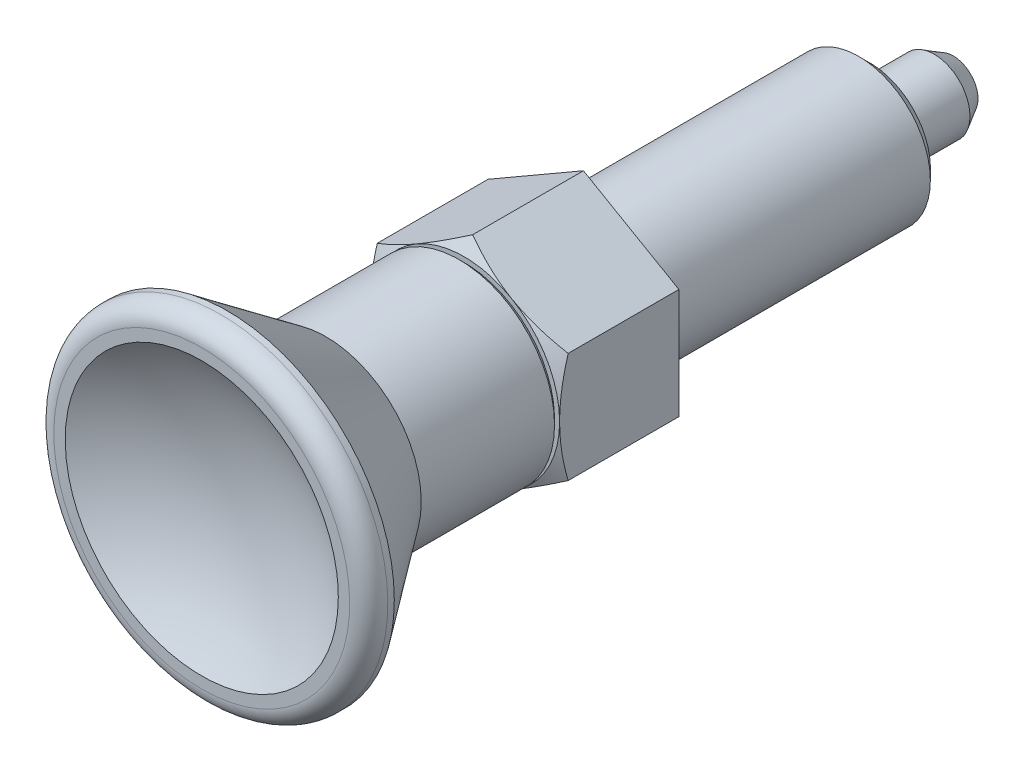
ISO-10303-21;
HEADER;
FILE_DESCRIPTION(('STEP AP214'),'2;1');
FILE_NAME('part.step','',(''),(''),'','','');
FILE_SCHEMA(('AUTOMOTIVE_DESIGN { 1 0 10303 214 1 1 1 1 }'));
ENDSEC;
DATA;
#1=APPLICATION_CONTEXT('core data for automotive mechanical design processes');
#2=APPLICATION_PROTOCOL_DEFINITION('international standard','automotive_design',2000,#1);
#3=PRODUCT_CONTEXT('',#1,'mechanical');
#4=PRODUCT('Part','Part','',(#3));
#5=PRODUCT_RELATED_PRODUCT_CATEGORY('part','',(#4));
#6=PRODUCT_DEFINITION_FORMATION('','',#4);
#7=PRODUCT_DEFINITION_CONTEXT('part definition',#1,'design');
#8=PRODUCT_DEFINITION('design','',#6,#7);
#9=PRODUCT_DEFINITION_SHAPE('','',#8);
#10=(LENGTH_UNIT() NAMED_UNIT(*) SI_UNIT(.MILLI.,.METRE.));
#11=(NAMED_UNIT(*) PLANE_ANGLE_UNIT() SI_UNIT($,.RADIAN.));
#12=(NAMED_UNIT(*) SI_UNIT($,.STERADIAN.) SOLID_ANGLE_UNIT());
#13=UNCERTAINTY_MEASURE_WITH_UNIT(LENGTH_MEASURE(1.E-05),#10,'distance_accuracy_value','');
#14=(GEOMETRIC_REPRESENTATION_CONTEXT(3) GLOBAL_UNCERTAINTY_ASSIGNED_CONTEXT((#13)) GLOBAL_UNIT_ASSIGNED_CONTEXT((#10,
#11,#12)) REPRESENTATION_CONTEXT('',''));
#15=CARTESIAN_POINT('',(0.,0.,0.));
#16=DIRECTION('',(0.,0.,1.));
#17=DIRECTION('',(1.,0.,0.));
#18=AXIS2_PLACEMENT_3D('',#15,#16,#17);
#19=CARTESIAN_POINT('',(0.,0.,0.));
#20=DIRECTION('',(0.,0.,1.));
#21=DIRECTION('',(0.,-1.,0.));
#22=AXIS2_PLACEMENT_3D('',#19,#20,#21);
#23=CYLINDRICAL_SURFACE('',#22,3.);
#24=CARTESIAN_POINT('',(0.,0.,0.));
#25=DIRECTION('',(0.,0.,1.));
#26=DIRECTION('',(0.,-1.,0.));
#27=AXIS2_PLACEMENT_3D('',#24,#25,#26);
#28=CIRCLE('',#27,3.);
#29=CARTESIAN_POINT('',(0.,-3.,0.));
#30=VERTEX_POINT('',#29);
#31=EDGE_CURVE('E129',#30,#30,#28,.T.);
#32=ORIENTED_EDGE('',*,*,#31,.F.);
#33=EDGE_LOOP('',(#32));
#34=FACE_BOUND('',#33,.T.);
#35=CARTESIAN_POINT('',(0.,0.,-11.54));
#36=DIRECTION('',(0.,0.,1.));
#37=DIRECTION('',(1.,0.,0.));
#38=AXIS2_PLACEMENT_3D('',#35,#36,#37);
#39=CIRCLE('',#38,3.);
#40=CARTESIAN_POINT('',(3.00000000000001,0.,-11.54));
#41=VERTEX_POINT('',#40);
#42=EDGE_CURVE('E382',#41,#41,#39,.T.);
#43=ORIENTED_EDGE('',*,*,#42,.T.);
#44=EDGE_LOOP('',(#43));
#45=FACE_BOUND('',#44,.T.);
#46=ADVANCED_FACE('F14',(#34,#45),#23,.T.);
#47=CARTESIAN_POINT('',(4.,-4.67422777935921,0.));
#48=DIRECTION('',(0.,0.,-1.));
#49=DIRECTION('',(-1.,0.,0.));
#50=AXIS2_PLACEMENT_3D('',#47,#48,#49);
#51=PLANE('',#50);
#52=ORIENTED_EDGE('',*,*,#31,.T.);
#53=EDGE_LOOP('',(#52));
#54=FACE_BOUND('',#53,.T.);
#55=DIRECTION('',(0.,-1.,0.));
#56=VECTOR('',#55,1.);
#57=CARTESIAN_POINT('',(-4.,0.,0.));
#58=LINE('',#57,#56);
#59=CARTESIAN_POINT('',(-4.,2.3094010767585,0.));
#60=VERTEX_POINT('',#59);
#61=CARTESIAN_POINT('',(-4.,-2.3094010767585,0.));
#62=VERTEX_POINT('',#61);
#63=EDGE_CURVE('E356',#60,#62,#58,.T.);
#64=ORIENTED_EDGE('',*,*,#63,.F.);
#65=DIRECTION('',(-0.866025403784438,-0.5,0.));
#66=VECTOR('',#65,1.);
#67=CARTESIAN_POINT('',(-2.,3.46410161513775,0.));
#68=LINE('',#67,#66);
#69=CARTESIAN_POINT('',(0.,4.61880215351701,0.));
#70=VERTEX_POINT('',#69);
#71=EDGE_CURVE('E371',#70,#60,#68,.T.);
#72=ORIENTED_EDGE('',*,*,#71,.F.);
#73=DIRECTION('',(-0.866025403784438,0.5,0.));
#74=VECTOR('',#73,1.);
#75=CARTESIAN_POINT('',(2.,3.46410161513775,0.));
#76=LINE('',#75,#74);
#77=CARTESIAN_POINT('',(4.,2.3094010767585,0.));
#78=VERTEX_POINT('',#77);
#79=EDGE_CURVE('E369',#78,#70,#76,.T.);
#80=ORIENTED_EDGE('',*,*,#79,.F.);
#81=DIRECTION('',(0.,1.,0.));
#82=VECTOR('',#81,1.);
#83=CARTESIAN_POINT('',(4.,0.,0.));
#84=LINE('',#83,#82);
#85=CARTESIAN_POINT('',(4.,-2.3094010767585,0.));
#86=VERTEX_POINT('',#85);
#87=EDGE_CURVE('E91',#86,#78,#84,.T.);
#88=ORIENTED_EDGE('',*,*,#87,.F.);
#89=DIRECTION('',(0.866025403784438,0.5,0.));
#90=VECTOR('',#89,1.);
#91=CARTESIAN_POINT('',(2.,-3.46410161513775,0.));
#92=LINE('',#91,#90);
#93=CARTESIAN_POINT('',(0.,-4.61880215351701,0.));
#94=VERTEX_POINT('',#93);
#95=EDGE_CURVE('E98',#94,#86,#92,.T.);
#96=ORIENTED_EDGE('',*,*,#95,.F.);
#97=DIRECTION('',(0.866025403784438,-0.5,0.));
#98=VECTOR('',#97,1.);
#99=CARTESIAN_POINT('',(-2.,-3.46410161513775,0.));
#100=LINE('',#99,#98);
#101=EDGE_CURVE('E349',#62,#94,#100,.T.);
#102=ORIENTED_EDGE('',*,*,#101,.F.);
#103=EDGE_LOOP('',(#64,#72,#80,#88,#96,#102));
#104=FACE_BOUND('',#103,.T.);
#105=ADVANCED_FACE('F242',(#54,#104),#51,.T.);
#106=CARTESIAN_POINT('',(0.,4.61880215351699,5.03));
#107=DIRECTION('',(0.5,0.866025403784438,0.));
#108=DIRECTION('',(0.866025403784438,-0.5,0.));
#109=AXIS2_PLACEMENT_3D('',#106,#107,#108);
#110=PLANE('',#109);
#111=CARTESIAN_POINT('',(4.,2.30940107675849,4.64273441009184));
#112=CARTESIAN_POINT('',(3.83720085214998,2.40339320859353,4.69701440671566));
#113=CARTESIAN_POINT('',(3.67309795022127,2.49813806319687,4.7467443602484));
#114=CARTESIAN_POINT('',(3.34344559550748,2.68846293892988,4.8344422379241));
#115=CARTESIAN_POINT('',(3.1779076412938,2.78403632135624,4.87246832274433));
#116=CARTESIAN_POINT('',(2.92803843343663,2.92829837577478,4.91915789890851));
#117=CARTESIAN_POINT('',(2.84443305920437,2.97656796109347,4.93300183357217));
#118=CARTESIAN_POINT('',(2.67682205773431,3.07333821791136,4.95696597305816));
#119=CARTESIAN_POINT('',(2.59281644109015,3.1218388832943,4.96708627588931));
#120=CARTESIAN_POINT('',(2.42409422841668,3.2192506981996,4.9834253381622));
#121=CARTESIAN_POINT('',(2.33937618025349,3.26816268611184,4.98962425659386));
#122=CARTESIAN_POINT('',(2.16977347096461,3.36608285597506,4.99792016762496));
#123=CARTESIAN_POINT('',(2.08488878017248,3.41509105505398,5.00001634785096));
#124=CARTESIAN_POINT('',(2.,3.46410161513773,5.));
#125=B_SPLINE_CURVE_WITH_KNOTS('',3,(#111,#112,#113,#114,#115,#116,#117,#118,#119,#120,#121,
#122,#123,#124),.UNSPECIFIED.,.F.,.F.,(4,2,2,2,2,2,4),(0.,0.587229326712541,1.17149154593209,
1.46400599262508,1.75651273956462,2.05048788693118,2.34452123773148),.UNSPECIFIED.);
#126=CARTESIAN_POINT('',(4.,2.30940107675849,4.64273441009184));
#127=VERTEX_POINT('',#126);
#128=CARTESIAN_POINT('',(2.,3.46410161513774,5.));
#129=VERTEX_POINT('',#128);
#130=EDGE_CURVE('E101',#127,#129,#125,.T.);
#131=ORIENTED_EDGE('',*,*,#130,.F.);
#132=DIRECTION('',(0.,0.,-1.));
#133=VECTOR('',#132,1.);
#134=CARTESIAN_POINT('',(4.,2.30940107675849,5.));
#135=LINE('',#134,#133);
#136=EDGE_CURVE('E93',#78,#127,#135,.F.);
#137=ORIENTED_EDGE('',*,*,#136,.F.);
#138=ORIENTED_EDGE('',*,*,#79,.T.);
#139=DIRECTION('',(0.,0.,-1.));
#140=VECTOR('',#139,1.);
#141=CARTESIAN_POINT('',(0.,4.61880215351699,5.));
#142=LINE('',#141,#140);
#143=CARTESIAN_POINT('',(-9.48905183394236E-12,4.61880215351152,4.642734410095));
#144=VERTEX_POINT('',#143);
#145=EDGE_CURVE('E375',#144,#70,#142,.T.);
#146=ORIENTED_EDGE('',*,*,#145,.F.);
#147=CARTESIAN_POINT('',(2.,3.46410161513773,5.));
#148=CARTESIAN_POINT('',(1.91511121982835,3.51311217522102,5.00001634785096));
#149=CARTESIAN_POINT('',(1.83022652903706,3.56212037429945,4.997920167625));
#150=CARTESIAN_POINT('',(1.66062381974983,3.66004054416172,4.98962425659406));
#151=CARTESIAN_POINT('',(1.57590577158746,3.70895253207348,4.98342533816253));
#152=CARTESIAN_POINT('',(1.40718355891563,3.80636434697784,4.96708627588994));
#153=CARTESIAN_POINT('',(1.32317794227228,3.85486501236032,4.95696597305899));
#154=CARTESIAN_POINT('',(1.15556694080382,3.95163526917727,4.93300183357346));
#155=CARTESIAN_POINT('',(1.07196156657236,3.99990485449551,4.91915789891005));
#156=CARTESIAN_POINT('',(0.822092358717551,4.14416690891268,4.87246832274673));
#157=CARTESIAN_POINT('',(0.656554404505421,4.23974029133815,4.83444223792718));
#158=CARTESIAN_POINT('',(0.326902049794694,4.43006516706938,4.746744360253));
#159=CARTESIAN_POINT('',(0.162799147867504,4.52481002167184,4.6970144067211));
#160=CARTESIAN_POINT('',(1.89834500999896E-11,4.61880215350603,4.64273441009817));
#161=B_SPLINE_CURVE_WITH_KNOTS('',3,(#147,#148,#149,#150,#151,#152,#153,#154,#155,#156,#157,
#158,#159,#160),.UNSPECIFIED.,.F.,.F.,(4,2,2,2,2,2,4),(0.,0.294033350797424,0.588008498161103,
0.880515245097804,1.17302969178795,1.75729191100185,2.34452123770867),.UNSPECIFIED.);
#162=EDGE_CURVE('E104',#129,#144,#161,.T.);
#163=ORIENTED_EDGE('',*,*,#162,.F.);
#164=EDGE_LOOP('',(#131,#137,#138,#146,#163));
#165=FACE_BOUND('',#164,.T.);
#166=ADVANCED_FACE('F102',(#165),#110,.T.);
#167=CARTESIAN_POINT('',(-4.,2.30940107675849,5.03));
#168=DIRECTION('',(-0.5,0.866025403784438,0.));
#169=DIRECTION('',(0.866025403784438,0.5,0.));
#170=AXIS2_PLACEMENT_3D('',#167,#168,#169);
#171=PLANE('',#170);
#172=CARTESIAN_POINT('',(-1.89779897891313E-11,4.61880215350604,4.64273441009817));
#173=CARTESIAN_POINT('',(-0.162799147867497,4.52481002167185,4.6970144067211));
#174=CARTESIAN_POINT('',(-0.326902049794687,4.43006516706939,4.746744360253));
#175=CARTESIAN_POINT('',(-0.656554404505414,4.23974029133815,4.83444223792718));
#176=CARTESIAN_POINT('',(-0.822092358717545,4.14416690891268,4.87246832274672));
#177=CARTESIAN_POINT('',(-1.07196156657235,3.99990485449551,4.91915789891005));
#178=CARTESIAN_POINT('',(-1.15556694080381,3.95163526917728,4.93300183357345));
#179=CARTESIAN_POINT('',(-1.32317794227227,3.85486501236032,4.95696597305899));
#180=CARTESIAN_POINT('',(-1.40718355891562,3.80636434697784,4.96708627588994));
#181=CARTESIAN_POINT('',(-1.57590577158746,3.70895253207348,4.98342533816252));
#182=CARTESIAN_POINT('',(-1.66062381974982,3.66004054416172,4.98962425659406));
#183=CARTESIAN_POINT('',(-1.83022652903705,3.56212037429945,4.99792016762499));
#184=CARTESIAN_POINT('',(-1.91511121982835,3.51311217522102,5.00001634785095));
#185=CARTESIAN_POINT('',(-2.,3.46410161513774,5.));
#186=B_SPLINE_CURVE_WITH_KNOTS('',3,(#172,#173,#174,#175,#176,#177,#178,#179,#180,#181,#182,
#183,#184,#185),.UNSPECIFIED.,.F.,.F.,(4,2,2,2,2,2,4),(0.,0.58722932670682,1.17149154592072,
1.46400599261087,1.75651273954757,2.05048788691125,2.34452123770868),.UNSPECIFIED.);
#187=CARTESIAN_POINT('',(-2.,3.46410161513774,5.));
#188=VERTEX_POINT('',#187);
#189=EDGE_CURVE('E230',#144,#188,#186,.T.);
#190=ORIENTED_EDGE('',*,*,#189,.F.);
#191=ORIENTED_EDGE('',*,*,#145,.T.);
#192=ORIENTED_EDGE('',*,*,#71,.T.);
#193=DIRECTION('',(0.,0.,-1.));
#194=VECTOR('',#193,1.);
#195=CARTESIAN_POINT('',(-4.,2.30940107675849,5.));
#196=LINE('',#195,#194);
#197=CARTESIAN_POINT('',(-4.,2.30940107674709,4.64273441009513));
#198=VERTEX_POINT('',#197);
#199=EDGE_CURVE('E352',#198,#60,#196,.T.);
#200=ORIENTED_EDGE('',*,*,#199,.F.);
#201=CARTESIAN_POINT('',(-2.,3.46410161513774,5.));
#202=CARTESIAN_POINT('',(-2.08488878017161,3.41509105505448,5.00001634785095));
#203=CARTESIAN_POINT('',(-2.16977347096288,3.36608285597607,4.99792016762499));
#204=CARTESIAN_POINT('',(-2.33937618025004,3.26816268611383,4.98962425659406));
#205=CARTESIAN_POINT('',(-2.42409422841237,3.21925069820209,4.98342533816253));
#206=CARTESIAN_POINT('',(-2.59281644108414,3.12183888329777,4.96708627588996));
#207=CARTESIAN_POINT('',(-2.67682205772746,3.07333821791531,4.95696597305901));
#208=CARTESIAN_POINT('',(-2.84443305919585,2.97656796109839,4.9330018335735));
#209=CARTESIAN_POINT('',(-2.92803843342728,2.92829837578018,4.91915789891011));
#210=CARTESIAN_POINT('',(-3.17790764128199,2.78403632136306,4.87246832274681));
#211=CARTESIAN_POINT('',(-3.34344559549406,2.68846293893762,4.83444223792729));
#212=CARTESIAN_POINT('',(-3.67309795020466,2.49813806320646,4.74674436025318));
#213=CARTESIAN_POINT('',(-3.83720085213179,2.40339320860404,4.69701440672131));
#214=CARTESIAN_POINT('',(-3.99999999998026,2.30940107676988,4.64273441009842));
#215=B_SPLINE_CURVE_WITH_KNOTS('',3,(#201,#202,#203,#204,#205,#206,#207,#208,#209,#210,#211,
#212,#213,#214),.UNSPECIFIED.,.F.,.F.,(4,2,2,2,2,2,4),(0.,0.294033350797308,0.588008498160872,
0.880515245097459,1.1730296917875,1.75729191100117,2.34452123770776),.UNSPECIFIED.);
#216=EDGE_CURVE('E214',#188,#198,#215,.T.);
#217=ORIENTED_EDGE('',*,*,#216,.F.);
#218=EDGE_LOOP('',(#190,#191,#192,#200,#217));
#219=FACE_BOUND('',#218,.T.);
#220=ADVANCED_FACE('F203',(#219),#171,.T.);
#221=CARTESIAN_POINT('',(-4.,-2.30940107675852,5.03));
#222=DIRECTION('',(-1.,0.,0.));
#223=DIRECTION('',(0.,1.,0.));
#224=AXIS2_PLACEMENT_3D('',#221,#222,#223);
#225=PLANE('',#224);
#226=CARTESIAN_POINT('',(-4.,2.30940107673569,4.64273441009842));
#227=CARTESIAN_POINT('',(-4.,2.12141681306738,4.69701440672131));
#228=CARTESIAN_POINT('',(-4.,1.93192710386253,4.74674436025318));
#229=CARTESIAN_POINT('',(-4.,1.55127735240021,4.83444223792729));
#230=CARTESIAN_POINT('',(-4.,1.36013058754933,4.87246832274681));
#231=CARTESIAN_POINT('',(-4.,1.0716064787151,4.9191578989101));
#232=CARTESIAN_POINT('',(-4.,0.97506730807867,4.93300183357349));
#233=CARTESIAN_POINT('',(-4.,0.78152679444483,4.95696597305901));
#234=CARTESIAN_POINT('',(-4.,0.684525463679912,4.96708627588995));
#235=CARTESIAN_POINT('',(-4.,0.489701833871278,4.98342533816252));
#236=CARTESIAN_POINT('',(-4.,0.391877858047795,4.98962425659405));
#237=CARTESIAN_POINT('',(-4.,0.196037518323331,4.99792016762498));
#238=CARTESIAN_POINT('',(-4.,0.0980211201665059,5.00001634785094));
#239=CARTESIAN_POINT('',(-4.,0.,5.));
#240=B_SPLINE_CURVE_WITH_KNOTS('',3,(#226,#227,#228,#229,#230,#231,#232,#233,#234,#235,#236,
#237,#238,#239),.UNSPECIFIED.,.F.,.F.,(4,2,2,2,2,2,4),(0.,0.587229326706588,1.17149154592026,
1.4640059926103,1.75651273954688,2.05048788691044,2.34452123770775),.UNSPECIFIED.);
#241=CARTESIAN_POINT('',(-4.,0.,5.));
#242=VERTEX_POINT('',#241);
#243=EDGE_CURVE('E207',#198,#242,#240,.T.);
#244=ORIENTED_EDGE('',*,*,#243,.F.);
#245=ORIENTED_EDGE('',*,*,#199,.T.);
#246=ORIENTED_EDGE('',*,*,#63,.T.);
#247=DIRECTION('',(0.,0.,-1.));
#248=VECTOR('',#247,1.);
#249=CARTESIAN_POINT('',(-4.,-2.30940107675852,5.));
#250=LINE('',#249,#248);
#251=CARTESIAN_POINT('',(-4.,-2.30940107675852,4.64273441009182));
#252=VERTEX_POINT('',#251);
#253=EDGE_CURVE('E350',#252,#62,#250,.T.);
#254=ORIENTED_EDGE('',*,*,#253,.F.);
#255=CARTESIAN_POINT('',(-4.,0.,5.));
#256=CARTESIAN_POINT('',(-4.,-0.0980211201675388,5.00001634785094));
#257=CARTESIAN_POINT('',(-4.,-0.196037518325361,4.99792016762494));
#258=CARTESIAN_POINT('',(-4.,-0.391877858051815,4.98962425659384));
#259=CARTESIAN_POINT('',(-4.,-0.489701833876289,4.98342533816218));
#260=CARTESIAN_POINT('',(-4.,-0.684525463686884,4.96708627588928));
#261=CARTESIAN_POINT('',(-4.,-0.781526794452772,4.95696597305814));
#262=CARTESIAN_POINT('',(-4.,-0.975067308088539,4.93300183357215));
#263=CARTESIAN_POINT('',(-4.,-1.07160647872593,4.91915789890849));
#264=CARTESIAN_POINT('',(-4.,-1.360130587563,4.87246832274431));
#265=CARTESIAN_POINT('',(-4.,-1.55127735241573,4.83444223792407));
#266=CARTESIAN_POINT('',(-4.,-1.93192710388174,4.74674436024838));
#267=CARTESIAN_POINT('',(-4.,-2.12141681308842,4.69701440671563));
#268=CARTESIAN_POINT('',(-4.,-2.30940107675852,4.64273441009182));
#269=B_SPLINE_CURVE_WITH_KNOTS('',3,(#255,#256,#257,#258,#259,#260,#261,#262,#263,#264,#265,
#266,#267,#268),.UNSPECIFIED.,.F.,.F.,(4,2,2,2,2,2,4),(0.,0.2940333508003,0.588008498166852,
0.880515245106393,1.17302969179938,1.75729191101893,2.34452123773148),.UNSPECIFIED.);
#270=EDGE_CURVE('E186',#242,#252,#269,.T.);
#271=ORIENTED_EDGE('',*,*,#270,.F.);
#272=EDGE_LOOP('',(#244,#245,#246,#254,#271));
#273=FACE_BOUND('',#272,.T.);
#274=ADVANCED_FACE('F199',(#273),#225,.T.);
#275=CARTESIAN_POINT('',(0.,-4.61880215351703,5.03));
#276=DIRECTION('',(-0.5,-0.866025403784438,0.));
#277=DIRECTION('',(-0.866025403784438,0.5,0.));
#278=AXIS2_PLACEMENT_3D('',#275,#276,#277);
#279=PLANE('',#278);
#280=CARTESIAN_POINT('',(-4.,-2.30940107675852,4.64273441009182));
#281=CARTESIAN_POINT('',(-3.83720085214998,-2.40339320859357,4.69701440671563));
#282=CARTESIAN_POINT('',(-3.67309795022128,-2.49813806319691,4.74674436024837));
#283=CARTESIAN_POINT('',(-3.34344559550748,-2.68846293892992,4.83444223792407));
#284=CARTESIAN_POINT('',(-3.1779076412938,-2.78403632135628,4.8724683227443));
#285=CARTESIAN_POINT('',(-2.92803843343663,-2.92829837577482,4.91915789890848));
#286=CARTESIAN_POINT('',(-2.84443305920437,-2.97656796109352,4.93300183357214));
#287=CARTESIAN_POINT('',(-2.67682205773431,-3.0733382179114,4.95696597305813));
#288=CARTESIAN_POINT('',(-2.59281644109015,-3.12183888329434,4.96708627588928));
#289=CARTESIAN_POINT('',(-2.42409422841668,-3.21925069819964,4.98342533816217));
#290=CARTESIAN_POINT('',(-2.33937618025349,-3.26816268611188,4.98962425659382));
#291=CARTESIAN_POINT('',(-2.16977347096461,-3.36608285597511,4.99792016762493));
#292=CARTESIAN_POINT('',(-2.08488878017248,-3.41509105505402,5.00001634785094));
#293=CARTESIAN_POINT('',(-2.,-3.46410161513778,5.));
#294=B_SPLINE_CURVE_WITH_KNOTS('',3,(#280,#281,#282,#283,#284,#285,#286,#287,#288,#289,#290,
#291,#292,#293),.UNSPECIFIED.,.F.,.F.,(4,2,2,2,2,2,4),(0.,0.587229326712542,1.1714915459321,
1.46400599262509,1.75651273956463,2.05048788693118,2.34452123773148),.UNSPECIFIED.);
#295=CARTESIAN_POINT('',(-2.,-3.46410161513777,5.));
#296=VERTEX_POINT('',#295);
#297=EDGE_CURVE('E193',#252,#296,#294,.T.);
#298=ORIENTED_EDGE('',*,*,#297,.F.);
#299=ORIENTED_EDGE('',*,*,#253,.T.);
#300=ORIENTED_EDGE('',*,*,#101,.T.);
#301=DIRECTION('',(0.,0.,-1.));
#302=VECTOR('',#301,1.);
#303=CARTESIAN_POINT('',(0.,-4.61880215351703,5.));
#304=LINE('',#303,#302);
#305=CARTESIAN_POINT('',(0.,-4.61880215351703,4.64273441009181));
#306=VERTEX_POINT('',#305);
#307=EDGE_CURVE('E111',#306,#94,#304,.T.);
#308=ORIENTED_EDGE('',*,*,#307,.F.);
#309=CARTESIAN_POINT('',(-2.,-3.46410161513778,5.));
#310=CARTESIAN_POINT('',(-1.91511121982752,-3.51311217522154,5.00001634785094));
#311=CARTESIAN_POINT('',(-1.8302265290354,-3.56212037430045,4.99792016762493));
#312=CARTESIAN_POINT('',(-1.66062381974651,-3.66004054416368,4.98962425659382));
#313=CARTESIAN_POINT('',(-1.57590577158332,-3.70895253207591,4.98342533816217));
#314=CARTESIAN_POINT('',(-1.40718355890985,-3.80636434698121,4.96708627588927));
#315=CARTESIAN_POINT('',(-1.3231779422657,-3.85486501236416,4.95696597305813));
#316=CARTESIAN_POINT('',(-1.15556694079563,-3.95163526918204,4.93300183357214));
#317=CARTESIAN_POINT('',(-1.07196156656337,-3.99990485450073,4.91915789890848));
#318=CARTESIAN_POINT('',(-0.822092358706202,-4.14416690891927,4.8724683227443));
#319=CARTESIAN_POINT('',(-0.656554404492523,-4.23974029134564,4.83444223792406));
#320=CARTESIAN_POINT('',(-0.326902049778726,-4.43006516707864,4.74674436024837));
#321=CARTESIAN_POINT('',(-0.162799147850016,-4.52481002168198,4.69701440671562));
#322=CARTESIAN_POINT('',(0.,-4.61880215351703,4.64273441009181));
#323=B_SPLINE_CURVE_WITH_KNOTS('',3,(#309,#310,#311,#312,#313,#314,#315,#316,#317,#318,#319,
#320,#321,#322),.UNSPECIFIED.,.F.,.F.,(4,2,2,2,2,2,4),(0.,0.2940333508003,0.588008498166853,
0.880515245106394,1.17302969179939,1.75729191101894,2.34452123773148),.UNSPECIFIED.);
#324=EDGE_CURVE('E151',#296,#306,#323,.T.);
#325=ORIENTED_EDGE('',*,*,#324,.F.);
#326=EDGE_LOOP('',(#298,#299,#300,#308,#325));
#327=FACE_BOUND('',#326,.T.);
#328=ADVANCED_FACE('F138',(#327),#279,.T.);
#329=CARTESIAN_POINT('',(4.,2.30940107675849,5.03));
#330=DIRECTION('',(1.,0.,0.));
#331=DIRECTION('',(0.,-1.,0.));
#332=AXIS2_PLACEMENT_3D('',#329,#330,#331);
#333=PLANE('',#332);
#334=CARTESIAN_POINT('',(4.,-2.30940107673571,4.64273441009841));
#335=CARTESIAN_POINT('',(4.,-2.12141681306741,4.6970144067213));
#336=CARTESIAN_POINT('',(4.,-1.93192710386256,4.74674436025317));
#337=CARTESIAN_POINT('',(4.,-1.55127735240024,4.83444223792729));
#338=CARTESIAN_POINT('',(4.,-1.36013058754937,4.87246832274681));
#339=CARTESIAN_POINT('',(4.,-1.07160647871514,4.9191578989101));
#340=CARTESIAN_POINT('',(4.,-0.975067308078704,4.93300183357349));
#341=CARTESIAN_POINT('',(4.,-0.781526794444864,4.95696597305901));
#342=CARTESIAN_POINT('',(4.,-0.684525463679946,4.96708627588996));
#343=CARTESIAN_POINT('',(4.,-0.489701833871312,4.98342533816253));
#344=CARTESIAN_POINT('',(4.,-0.39187785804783,4.98962425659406));
#345=CARTESIAN_POINT('',(4.,-0.196037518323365,4.99792016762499));
#346=CARTESIAN_POINT('',(4.,-0.0980211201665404,5.00001634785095));
#347=CARTESIAN_POINT('',(4.,0.,5.));
#348=B_SPLINE_CURVE_WITH_KNOTS('',3,(#334,#335,#336,#337,#338,#339,#340,#341,#342,#343,#344,
#345,#346,#347),.UNSPECIFIED.,.F.,.F.,(4,2,2,2,2,2,4),(0.,0.587229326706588,1.17149154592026,
1.46400599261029,1.75651273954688,2.05048788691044,2.34452123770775),.UNSPECIFIED.);
#349=CARTESIAN_POINT('',(4.,-2.30940107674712,4.64273441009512));
#350=VERTEX_POINT('',#349);
#351=CARTESIAN_POINT('',(4.,0.,5.));
#352=VERTEX_POINT('',#351);
#353=EDGE_CURVE('E69',#350,#352,#348,.T.);
#354=ORIENTED_EDGE('',*,*,#353,.F.);
#355=DIRECTION('',(0.,0.,-1.));
#356=VECTOR('',#355,1.);
#357=CARTESIAN_POINT('',(4.,-2.30940107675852,5.));
#358=LINE('',#357,#356);
#359=EDGE_CURVE('E114',#86,#350,#358,.F.);
#360=ORIENTED_EDGE('',*,*,#359,.F.);
#361=ORIENTED_EDGE('',*,*,#87,.T.);
#362=ORIENTED_EDGE('',*,*,#136,.T.);
#363=CARTESIAN_POINT('',(4.,0.,5.));
#364=CARTESIAN_POINT('',(4.,0.098021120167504,5.00001634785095));
#365=CARTESIAN_POINT('',(4.,0.196037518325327,4.99792016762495));
#366=CARTESIAN_POINT('',(4.,0.391877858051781,4.98962425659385));
#367=CARTESIAN_POINT('',(4.,0.489701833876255,4.98342533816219));
#368=CARTESIAN_POINT('',(4.,0.684525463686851,4.9670862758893));
#369=CARTESIAN_POINT('',(4.,0.781526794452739,4.95696597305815));
#370=CARTESIAN_POINT('',(4.,0.975067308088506,4.93300183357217));
#371=CARTESIAN_POINT('',(4.,1.0716064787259,4.91915789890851));
#372=CARTESIAN_POINT('',(4.,1.36013058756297,4.87246832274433));
#373=CARTESIAN_POINT('',(4.,1.5512773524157,4.83444223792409));
#374=CARTESIAN_POINT('',(4.,1.93192710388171,4.7467443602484));
#375=CARTESIAN_POINT('',(4.,2.12141681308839,4.69701440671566));
#376=CARTESIAN_POINT('',(4.,2.30940107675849,4.64273441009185));
#377=B_SPLINE_CURVE_WITH_KNOTS('',3,(#363,#364,#365,#366,#367,#368,#369,#370,#371,#372,#373,
#374,#375,#376),.UNSPECIFIED.,.F.,.F.,(4,2,2,2,2,2,4),(0.,0.2940333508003,0.588008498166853,
0.880515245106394,1.17302969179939,1.75729191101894,2.34452123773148),.UNSPECIFIED.);
#378=EDGE_CURVE('E65',#352,#127,#377,.T.);
#379=ORIENTED_EDGE('',*,*,#378,.F.);
#380=EDGE_LOOP('',(#354,#360,#361,#362,#379));
#381=FACE_BOUND('',#380,.T.);
#382=ADVANCED_FACE('F95',(#381),#333,.T.);
#383=CARTESIAN_POINT('',(4.,-2.30940107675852,5.03));
#384=DIRECTION('',(0.5,-0.866025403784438,0.));
#385=DIRECTION('',(-0.866025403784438,-0.5,0.));
#386=AXIS2_PLACEMENT_3D('',#383,#384,#385);
#387=PLANE('',#386);
#388=CARTESIAN_POINT('',(0.,-4.61880215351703,4.64273441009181));
#389=CARTESIAN_POINT('',(0.162799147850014,-4.52481002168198,4.69701440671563));
#390=CARTESIAN_POINT('',(0.326902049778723,-4.43006516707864,4.74674436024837));
#391=CARTESIAN_POINT('',(0.656554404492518,-4.23974029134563,4.83444223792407));
#392=CARTESIAN_POINT('',(0.822092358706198,-4.14416690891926,4.8724683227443));
#393=CARTESIAN_POINT('',(1.07196156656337,-3.99990485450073,4.91915789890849));
#394=CARTESIAN_POINT('',(1.15556694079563,-3.95163526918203,4.93300183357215));
#395=CARTESIAN_POINT('',(1.32317794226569,-3.85486501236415,4.95696597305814));
#396=CARTESIAN_POINT('',(1.40718355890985,-3.8063643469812,4.96708627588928));
#397=CARTESIAN_POINT('',(1.57590577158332,-3.70895253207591,4.98342533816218));
#398=CARTESIAN_POINT('',(1.66062381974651,-3.66004054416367,4.98962425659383));
#399=CARTESIAN_POINT('',(1.83022652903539,-3.56212037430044,4.99792016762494));
#400=CARTESIAN_POINT('',(1.91511121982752,-3.51311217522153,5.00001634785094));
#401=CARTESIAN_POINT('',(2.,-3.46410161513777,5.));
#402=B_SPLINE_CURVE_WITH_KNOTS('',3,(#388,#389,#390,#391,#392,#393,#394,#395,#396,#397,#398,
#399,#400,#401),.UNSPECIFIED.,.F.,.F.,(4,2,2,2,2,2,4),(0.,0.587229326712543,1.1714915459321,
1.46400599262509,1.75651273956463,2.05048788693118,2.34452123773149),.UNSPECIFIED.);
#403=CARTESIAN_POINT('',(2.,-3.46410161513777,5.));
#404=VERTEX_POINT('',#403);
#405=EDGE_CURVE('E180',#306,#404,#402,.T.);
#406=ORIENTED_EDGE('',*,*,#405,.F.);
#407=ORIENTED_EDGE('',*,*,#307,.T.);
#408=ORIENTED_EDGE('',*,*,#95,.T.);
#409=ORIENTED_EDGE('',*,*,#359,.T.);
#410=CARTESIAN_POINT('',(2.,-3.46410161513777,5.));
#411=CARTESIAN_POINT('',(2.08488878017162,-3.41509105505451,5.00001634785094));
#412=CARTESIAN_POINT('',(2.16977347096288,-3.36608285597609,4.99792016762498));
#413=CARTESIAN_POINT('',(2.33937618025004,-3.26816268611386,4.98962425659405));
#414=CARTESIAN_POINT('',(2.42409422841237,-3.21925069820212,4.98342533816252));
#415=CARTESIAN_POINT('',(2.59281644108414,-3.1218388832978,4.96708627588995));
#416=CARTESIAN_POINT('',(2.67682205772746,-3.07333821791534,4.956965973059));
#417=CARTESIAN_POINT('',(2.84443305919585,-2.97656796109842,4.93300183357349));
#418=CARTESIAN_POINT('',(2.92803843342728,-2.92829837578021,4.9191578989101));
#419=CARTESIAN_POINT('',(3.17790764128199,-2.78403632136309,4.87246832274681));
#420=CARTESIAN_POINT('',(3.34344559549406,-2.68846293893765,4.83444223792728));
#421=CARTESIAN_POINT('',(3.67309795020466,-2.49813806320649,4.74674436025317));
#422=CARTESIAN_POINT('',(3.83720085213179,-2.40339320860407,4.6970144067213));
#423=CARTESIAN_POINT('',(3.99999999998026,-2.30940107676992,4.64273441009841));
#424=B_SPLINE_CURVE_WITH_KNOTS('',3,(#410,#411,#412,#413,#414,#415,#416,#417,#418,#419,#420,
#421,#422,#423),.UNSPECIFIED.,.F.,.F.,(4,2,2,2,2,2,4),(0.,0.294033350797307,0.588008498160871,
0.880515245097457,1.17302969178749,1.75729191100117,2.34452123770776),.UNSPECIFIED.);
#425=EDGE_CURVE('E33',#404,#350,#424,.T.);
#426=ORIENTED_EDGE('',*,*,#425,.F.);
#427=EDGE_LOOP('',(#406,#407,#408,#409,#426));
#428=FACE_BOUND('',#427,.T.);
#429=ADVANCED_FACE('F137',(#428),#387,.T.);
#430=CARTESIAN_POINT('',(0.,0.,5.));
#431=DIRECTION('',(0.,0.,-1.));
#432=DIRECTION('',(0.,1.,0.));
#433=AXIS2_PLACEMENT_3D('',#430,#431,#432);
#434=CONICAL_SURFACE('',#433,4.,1.0471975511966);
#435=ORIENTED_EDGE('',*,*,#130,.T.);
#436=CARTESIAN_POINT('',(0.,0.,5.));
#437=DIRECTION('',(0.,0.,-1.));
#438=DIRECTION('',(0.,1.,0.));
#439=AXIS2_PLACEMENT_3D('',#436,#437,#438);
#440=CIRCLE('',#439,4.);
#441=EDGE_CURVE('E110',#352,#129,#440,.F.);
#442=ORIENTED_EDGE('',*,*,#441,.F.);
#443=ORIENTED_EDGE('',*,*,#378,.T.);
#444=EDGE_LOOP('',(#435,#442,#443));
#445=FACE_BOUND('',#444,.T.);
#446=ADVANCED_FACE('F108',(#445),#434,.T.);
#447=CARTESIAN_POINT('',(0.,0.,5.));
#448=DIRECTION('',(0.,0.,-1.));
#449=DIRECTION('',(0.,1.,0.));
#450=AXIS2_PLACEMENT_3D('',#447,#448,#449);
#451=CONICAL_SURFACE('',#450,4.,1.0471975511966);
#452=ORIENTED_EDGE('',*,*,#189,.T.);
#453=CARTESIAN_POINT('',(0.,0.,5.));
#454=DIRECTION('',(0.,0.,-1.));
#455=DIRECTION('',(0.,1.,0.));
#456=AXIS2_PLACEMENT_3D('',#453,#454,#455);
#457=CIRCLE('',#456,4.);
#458=EDGE_CURVE('E336',#129,#188,#457,.F.);
#459=ORIENTED_EDGE('',*,*,#458,.F.);
#460=ORIENTED_EDGE('',*,*,#162,.T.);
#461=EDGE_LOOP('',(#452,#459,#460));
#462=FACE_BOUND('',#461,.T.);
#463=ADVANCED_FACE('F223',(#462),#451,.T.);
#464=CARTESIAN_POINT('',(0.,0.,5.));
#465=DIRECTION('',(0.,0.,-1.));
#466=DIRECTION('',(0.,1.,0.));
#467=AXIS2_PLACEMENT_3D('',#464,#465,#466);
#468=CONICAL_SURFACE('',#467,4.,1.0471975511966);
#469=ORIENTED_EDGE('',*,*,#243,.T.);
#470=CARTESIAN_POINT('',(0.,0.,5.));
#471=DIRECTION('',(0.,0.,-1.));
#472=DIRECTION('',(0.,1.,0.));
#473=AXIS2_PLACEMENT_3D('',#470,#471,#472);
#474=CIRCLE('',#473,4.);
#475=EDGE_CURVE('E333',#188,#242,#474,.F.);
#476=ORIENTED_EDGE('',*,*,#475,.F.);
#477=ORIENTED_EDGE('',*,*,#216,.T.);
#478=EDGE_LOOP('',(#469,#476,#477));
#479=FACE_BOUND('',#478,.T.);
#480=ADVANCED_FACE('F220',(#479),#468,.T.);
#481=CARTESIAN_POINT('',(0.,0.,5.));
#482=DIRECTION('',(0.,0.,-1.));
#483=DIRECTION('',(0.,1.,0.));
#484=AXIS2_PLACEMENT_3D('',#481,#482,#483);
#485=CONICAL_SURFACE('',#484,4.,1.0471975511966);
#486=CARTESIAN_POINT('',(0.,0.,5.));
#487=DIRECTION('',(0.,0.,-1.));
#488=DIRECTION('',(0.,1.,0.));
#489=AXIS2_PLACEMENT_3D('',#486,#487,#488);
#490=CIRCLE('',#489,4.);
#491=EDGE_CURVE('E330',#242,#296,#490,.F.);
#492=ORIENTED_EDGE('',*,*,#491,.F.);
#493=ORIENTED_EDGE('',*,*,#270,.T.);
#494=ORIENTED_EDGE('',*,*,#297,.T.);
#495=EDGE_LOOP('',(#492,#493,#494));
#496=FACE_BOUND('',#495,.T.);
#497=ADVANCED_FACE('F175',(#496),#485,.T.);
#498=CARTESIAN_POINT('',(0.,0.,5.));
#499=DIRECTION('',(0.,0.,-1.));
#500=DIRECTION('',(0.,1.,0.));
#501=AXIS2_PLACEMENT_3D('',#498,#499,#500);
#502=CONICAL_SURFACE('',#501,4.,1.0471975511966);
#503=CARTESIAN_POINT('',(0.,0.,5.));
#504=DIRECTION('',(0.,0.,-1.));
#505=DIRECTION('',(0.,1.,0.));
#506=AXIS2_PLACEMENT_3D('',#503,#504,#505);
#507=CIRCLE('',#506,4.);
#508=EDGE_CURVE('E327',#296,#404,#507,.F.);
#509=ORIENTED_EDGE('',*,*,#508,.F.);
#510=ORIENTED_EDGE('',*,*,#324,.T.);
#511=ORIENTED_EDGE('',*,*,#405,.T.);
#512=EDGE_LOOP('',(#509,#510,#511));
#513=FACE_BOUND('',#512,.T.);
#514=ADVANCED_FACE('F168',(#513),#502,.T.);
#515=CARTESIAN_POINT('',(0.,0.,5.));
#516=DIRECTION('',(0.,0.,-1.));
#517=DIRECTION('',(0.,1.,0.));
#518=AXIS2_PLACEMENT_3D('',#515,#516,#517);
#519=CONICAL_SURFACE('',#518,4.,1.0471975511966);
#520=CARTESIAN_POINT('',(0.,0.,5.));
#521=DIRECTION('',(0.,0.,-1.));
#522=DIRECTION('',(0.,1.,0.));
#523=AXIS2_PLACEMENT_3D('',#520,#521,#522);
#524=CIRCLE('',#523,4.);
#525=EDGE_CURVE('E324',#404,#352,#524,.F.);
#526=ORIENTED_EDGE('',*,*,#525,.F.);
#527=ORIENTED_EDGE('',*,*,#425,.T.);
#528=ORIENTED_EDGE('',*,*,#353,.T.);
#529=EDGE_LOOP('',(#526,#527,#528));
#530=FACE_BOUND('',#529,.T.);
#531=ADVANCED_FACE('F163',(#530),#519,.T.);
#532=CARTESIAN_POINT('',(-4.,-4.04800330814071,5.));
#533=DIRECTION('',(0.,0.,1.));
#534=DIRECTION('',(1.,0.,0.));
#535=AXIS2_PLACEMENT_3D('',#532,#533,#534);
#536=PLANE('',#535);
#537=CARTESIAN_POINT('',(0.,0.,5.));
#538=DIRECTION('',(0.,0.,1.));
#539=DIRECTION('',(0.,-1.,0.));
#540=AXIS2_PLACEMENT_3D('',#537,#538,#539);
#541=CIRCLE('',#540,3.78786796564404);
#542=CARTESIAN_POINT('',(0.,-3.78786796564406,4.99999999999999));
#543=VERTEX_POINT('',#542);
#544=EDGE_CURVE('E320',#543,#543,#541,.T.);
#545=ORIENTED_EDGE('',*,*,#544,.F.);
#546=EDGE_LOOP('',(#545));
#547=FACE_BOUND('',#546,.T.);
#548=ORIENTED_EDGE('',*,*,#508,.T.);
#549=ORIENTED_EDGE('',*,*,#525,.T.);
#550=ORIENTED_EDGE('',*,*,#441,.T.);
#551=ORIENTED_EDGE('',*,*,#458,.T.);
#552=ORIENTED_EDGE('',*,*,#475,.T.);
#553=ORIENTED_EDGE('',*,*,#491,.T.);
#554=EDGE_LOOP('',(#548,#549,#550,#551,#552,#553));
#555=FACE_BOUND('',#554,.T.);
#556=ADVANCED_FACE('F167',(#547,#555),#536,.T.);
#557=CARTESIAN_POINT('',(0.,0.,5.));
#558=DIRECTION('',(0.,0.,1.));
#559=DIRECTION('',(0.,-1.,0.));
#560=AXIS2_PLACEMENT_3D('',#557,#558,#559);
#561=CONICAL_SURFACE('',#560,3.78786796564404,0.785398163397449);
#562=ORIENTED_EDGE('',*,*,#544,.T.);
#563=EDGE_LOOP('',(#562));
#564=FACE_BOUND('',#563,.T.);
#565=CARTESIAN_POINT('',(0.,0.,5.21213203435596));
#566=DIRECTION('',(0.,0.,1.));
#567=DIRECTION('',(1.,0.,0.));
#568=AXIS2_PLACEMENT_3D('',#565,#566,#567);
#569=CIRCLE('',#568,4.);
#570=CARTESIAN_POINT('',(4.,0.,5.21213203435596));
#571=VERTEX_POINT('',#570);
#572=EDGE_CURVE('E323',#571,#571,#569,.T.);
#573=ORIENTED_EDGE('',*,*,#572,.F.);
#574=EDGE_LOOP('',(#573));
#575=FACE_BOUND('',#574,.T.);
#576=ADVANCED_FACE('F439',(#564,#575),#561,.T.);
#577=CARTESIAN_POINT('',(0.,0.,10.8));
#578=DIRECTION('',(0.,0.,1.));
#579=DIRECTION('',(0.,-1.,0.));
#580=AXIS2_PLACEMENT_3D('',#577,#578,#579);
#581=CYLINDRICAL_SURFACE('',#580,4.);
#582=ORIENTED_EDGE('',*,*,#572,.T.);
#583=EDGE_LOOP('',(#582));
#584=FACE_BOUND('',#583,.T.);
#585=CARTESIAN_POINT('',(0.,0.,10.8));
#586=DIRECTION('',(0.,0.,-1.));
#587=DIRECTION('',(1.,0.,0.));
#588=AXIS2_PLACEMENT_3D('',#585,#586,#587);
#589=CIRCLE('',#588,4.);
#590=CARTESIAN_POINT('',(4.,0.,10.8));
#591=VERTEX_POINT('',#590);
#592=EDGE_CURVE('E301',#591,#591,#589,.F.);
#593=ORIENTED_EDGE('',*,*,#592,.F.);
#594=EDGE_LOOP('',(#593));
#595=FACE_BOUND('',#594,.T.);
#596=ADVANCED_FACE('F447',(#584,#595),#581,.T.);
#597=CARTESIAN_POINT('',(0.,0.,10.8));
#598=DIRECTION('',(0.,0.,1.));
#599=DIRECTION('',(0.,-1.,0.));
#600=AXIS2_PLACEMENT_3D('',#597,#598,#599);
#601=CONICAL_SURFACE('',#600,4.,0.628318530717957);
#602=ORIENTED_EDGE('',*,*,#592,.T.);
#603=EDGE_LOOP('',(#602));
#604=FACE_BOUND('',#603,.T.);
#605=CARTESIAN_POINT('',(0.,0.,14.9291457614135));
#606=DIRECTION('',(0.,0.,1.));
#607=DIRECTION('',(1.,0.,0.));
#608=AXIS2_PLACEMENT_3D('',#605,#606,#607);
#609=CIRCLE('',#608,7.);
#610=CARTESIAN_POINT('',(7.,0.,14.9291457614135));
#611=VERTEX_POINT('',#610);
#612=EDGE_CURVE('E294',#611,#611,#609,.T.);
#613=ORIENTED_EDGE('',*,*,#612,.F.);
#614=EDGE_LOOP('',(#613));
#615=FACE_BOUND('',#614,.T.);
#616=ADVANCED_FACE('F310',(#604,#615),#601,.T.);
#617=CARTESIAN_POINT('',(0.,0.,24.2));
#618=DIRECTION('',(0.,-1.,0.));
#619=DIRECTION('',(-1.,0.,0.));
#620=AXIS2_PLACEMENT_3D('',#617,#618,#619);
#621=SPHERICAL_SURFACE('',#620,10.);
#622=CARTESIAN_POINT('',(5.72363520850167,0.,16.));
#623=CARTESIAN_POINT('',(5.72363432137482,-0.160701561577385,16.));
#624=CARTESIAN_POINT('',(5.71686155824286,-0.321432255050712,16.));
#625=CARTESIAN_POINT('',(5.68981243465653,-0.64178549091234,16.));
#626=CARTESIAN_POINT('',(5.66953208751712,-0.801407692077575,16.));
#627=CARTESIAN_POINT('',(5.61556580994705,-1.11863540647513,16.));
#628=CARTESIAN_POINT('',(5.58185859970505,-1.2762373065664,16.));
#629=CARTESIAN_POINT('',(5.5012457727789,-1.58816446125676,16.));
#630=CARTESIAN_POINT('',(5.45432944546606,-1.74248694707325,16.));
#631=CARTESIAN_POINT('',(5.34773636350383,-2.04636173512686,16.));
#632=CARTESIAN_POINT('',(5.28808171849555,-2.19592179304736,16.));
#633=CARTESIAN_POINT('',(5.15635830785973,-2.48955284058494,16.));
#634=CARTESIAN_POINT('',(5.08428393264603,-2.63362131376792,16.));
#635=CARTESIAN_POINT('',(4.92824937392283,-2.91517826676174,16.));
#636=CARTESIAN_POINT('',(4.84428874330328,-3.05266649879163,16.));
#637=CARTESIAN_POINT('',(4.66512147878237,-3.32001874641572,16.));
#638=CARTESIAN_POINT('',(4.56991994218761,-3.44988617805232,16.));
#639=CARTESIAN_POINT('',(4.36885200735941,-3.70122255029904,16.));
#640=CARTESIAN_POINT('',(4.26297875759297,-3.8226860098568,16.));
#641=CARTESIAN_POINT('',(4.04147907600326,-4.0561451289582,16.));
#642=CARTESIAN_POINT('',(3.92586214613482,-4.16814980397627,16.));
#643=CARTESIAN_POINT('',(3.6855537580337,-4.38207521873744,16.));
#644=CARTESIAN_POINT('',(3.56085821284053,-4.48399136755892,16.));
#645=CARTESIAN_POINT('',(3.30329543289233,-4.67697990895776,16.));
#646=CARTESIAN_POINT('',(3.1704263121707,-4.76804978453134,16.));
#647=CARTESIAN_POINT('',(2.89753354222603,-4.93864188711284,16.));
#648=CARTESIAN_POINT('',(2.75751232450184,-5.01816800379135,16.));
#649=CARTESIAN_POINT('',(2.47121634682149,-5.16517115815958,16.));
#650=CARTESIAN_POINT('',(2.32493930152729,-5.23264374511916,16.));
#651=CARTESIAN_POINT('',(2.02727721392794,-5.35500053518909,16.));
#652=CARTESIAN_POINT('',(1.87589414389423,-5.40988953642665,16.));
#653=CARTESIAN_POINT('',(1.56898530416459,-5.50674023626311,16.));
#654=CARTESIAN_POINT('',(1.41345800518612,-5.5486970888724,16.));
#655=CARTESIAN_POINT('',(1.09948547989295,-5.61934280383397,16.));
#656=CARTESIAN_POINT('',(0.941041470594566,-5.64803707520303,16.));
#657=CARTESIAN_POINT('',(0.622227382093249,-5.69198896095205,16.));
#658=CARTESIAN_POINT('',(0.461856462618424,-5.70724048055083,16.));
#659=CARTESIAN_POINT('',(0.140399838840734,-5.72417620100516,16.));
#660=CARTESIAN_POINT('',(-0.0206858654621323,-5.72586040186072,16.));
#661=CARTESIAN_POINT('',(-0.342353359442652,-5.71565184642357,16.));
#662=CARTESIAN_POINT('',(-0.502935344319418,-5.70376523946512,16.));
#663=CARTESIAN_POINT('',(-0.822592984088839,-5.6665018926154,16.));
#664=CARTESIAN_POINT('',(-0.981667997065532,-5.64111964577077,16.));
#665=CARTESIAN_POINT('',(-1.29705459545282,-5.57705415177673,16.));
#666=CARTESIAN_POINT('',(-1.45336719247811,-5.53837588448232,16.));
#667=CARTESIAN_POINT('',(-1.76223833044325,-5.44797387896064,16.));
#668=CARTESIAN_POINT('',(-1.91479541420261,-5.39624516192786,16.));
#669=CARTESIAN_POINT('',(-2.21495312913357,-5.28013891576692,16.));
#670=CARTESIAN_POINT('',(-2.36255556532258,-5.21576605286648,16.));
#671=CARTESIAN_POINT('',(-2.65186292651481,-5.07479307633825,16.));
#672=CARTESIAN_POINT('',(-2.79356584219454,-4.99818883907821,16.));
#673=CARTESIAN_POINT('',(-3.06998142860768,-4.83333257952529,16.));
#674=CARTESIAN_POINT('',(-3.20469571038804,-4.74508325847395,16.));
#675=CARTESIAN_POINT('',(-3.46615240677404,-4.55759299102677,16.));
#676=CARTESIAN_POINT('',(-3.59289840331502,-4.45835703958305,16.));
#677=CARTESIAN_POINT('',(-3.83770305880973,-4.24946484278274,16.));
#678=CARTESIAN_POINT('',(-3.95575321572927,-4.13979863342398,16.));
#679=CARTESIAN_POINT('',(-4.18211772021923,-3.91098124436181,16.));
#680=CARTESIAN_POINT('',(-4.29043830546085,-3.79183623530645,16.));
#681=CARTESIAN_POINT('',(-4.49670627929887,-3.54479037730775,16.));
#682=CARTESIAN_POINT('',(-4.59464895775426,-3.41688559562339,16.));
#683=CARTESIAN_POINT('',(-4.77940487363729,-3.1532829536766,16.));
#684=CARTESIAN_POINT('',(-4.86621852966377,-3.01758538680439,16.));
#685=CARTESIAN_POINT('',(-5.02806659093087,-2.73942094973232,16.));
#686=CARTESIAN_POINT('',(-5.10310631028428,-2.5969571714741,16.));
#687=CARTESIAN_POINT('',(-5.24103954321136,-2.30596508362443,16.));
#688=CARTESIAN_POINT('',(-5.30391188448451,-2.15742673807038,16.));
#689=CARTESIAN_POINT('',(-5.41685480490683,-1.85569693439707,16.));
#690=CARTESIAN_POINT('',(-5.46693574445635,-1.70250935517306,16.));
#691=CARTESIAN_POINT('',(-5.55393659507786,-1.39270839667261,16.));
#692=CARTESIAN_POINT('',(-5.59087728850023,-1.2361008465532,16.));
#693=CARTESIAN_POINT('',(-5.65143841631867,-0.92036329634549,16.));
#694=CARTESIAN_POINT('',(-5.67506277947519,-0.761234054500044,16.));
#695=CARTESIAN_POINT('',(-5.7025031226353,-0.501548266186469,16.));
#696=CARTESIAN_POINT('',(-5.71042518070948,-0.401407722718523,16.));
#697=CARTESIAN_POINT('',(-5.7209915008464,-0.20084857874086,16.));
#698=CARTESIAN_POINT('',(-5.72363576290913,-0.100429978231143,16.));
#699=CARTESIAN_POINT('',(-5.72363432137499,0.160701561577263,16.));
#700=CARTESIAN_POINT('',(-5.71686155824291,0.321432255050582,16.));
#701=CARTESIAN_POINT('',(-5.68981243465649,0.641785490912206,16.));
#702=CARTESIAN_POINT('',(-5.66953208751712,0.801407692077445,16.));
#703=CARTESIAN_POINT('',(-5.61556580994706,1.118635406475,16.));
#704=CARTESIAN_POINT('',(-5.58185859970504,1.27623730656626,16.));
#705=CARTESIAN_POINT('',(-5.50124577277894,1.58816446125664,16.));
#706=CARTESIAN_POINT('',(-5.45432944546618,1.74248694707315,16.));
#707=CARTESIAN_POINT('',(-5.34773636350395,2.04636173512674,16.));
#708=CARTESIAN_POINT('',(-5.2880817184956,2.1959217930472,16.));
#709=CARTESIAN_POINT('',(-5.15635830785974,2.48955284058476,16.));
#710=CARTESIAN_POINT('',(-5.08428393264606,2.63362131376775,16.));
#711=CARTESIAN_POINT('',(-4.92824937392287,2.91517826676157,16.));
#712=CARTESIAN_POINT('',(-4.84428874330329,3.05266649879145,16.));
#713=CARTESIAN_POINT('',(-4.66512147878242,3.32001874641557,16.));
#714=CARTESIAN_POINT('',(-4.56991994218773,3.44988617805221,16.));
#715=CARTESIAN_POINT('',(-4.36885200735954,3.70122255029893,16.));
#716=CARTESIAN_POINT('',(-4.26297875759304,3.82268600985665,16.));
#717=CARTESIAN_POINT('',(-4.04147907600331,4.05614512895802,16.));
#718=CARTESIAN_POINT('',(-3.92586214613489,4.1681498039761,16.));
#719=CARTESIAN_POINT('',(-3.68555375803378,4.38207521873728,16.));
#720=CARTESIAN_POINT('',(-3.56085821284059,4.48399136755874,16.));
#721=CARTESIAN_POINT('',(-3.30329543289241,4.67697990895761,16.));
#722=CARTESIAN_POINT('',(-3.17042631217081,4.76804978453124,16.));
#723=CARTESIAN_POINT('',(-2.89753354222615,4.93864188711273,16.));
#724=CARTESIAN_POINT('',(-2.75751232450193,5.0181680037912,16.));
#725=CARTESIAN_POINT('',(-2.47121634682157,5.16517115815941,16.));
#726=CARTESIAN_POINT('',(-2.32493930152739,5.232643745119,16.));
#727=CARTESIAN_POINT('',(-2.02727721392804,5.35500053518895,16.));
#728=CARTESIAN_POINT('',(-1.87589414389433,5.40988953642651,16.0000000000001));
#729=CARTESIAN_POINT('',(-1.5689853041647,5.50674023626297,16.));
#730=CARTESIAN_POINT('',(-1.41345800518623,5.54869708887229,16.));
#731=CARTESIAN_POINT('',(-1.09948547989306,5.61934280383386,16.));
#732=CARTESIAN_POINT('',(-0.94104147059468,5.6480370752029,16.));
#733=CARTESIAN_POINT('',(-0.622227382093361,5.69198896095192,16.0000000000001));
#734=CARTESIAN_POINT('',(-0.461856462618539,5.70724048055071,16.));
#735=CARTESIAN_POINT('',(-0.140399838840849,5.72417620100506,16.));
#736=CARTESIAN_POINT('',(0.0206858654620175,5.72586040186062,16.0000000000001));
#737=CARTESIAN_POINT('',(0.342353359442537,5.71565184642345,16.));
#738=CARTESIAN_POINT('',(0.502935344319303,5.703765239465,16.));
#739=CARTESIAN_POINT('',(0.822592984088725,5.66650189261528,16.));
#740=CARTESIAN_POINT('',(0.981667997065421,5.64111964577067,16.));
#741=CARTESIAN_POINT('',(1.29705459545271,5.57705415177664,16.0000000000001));
#742=CARTESIAN_POINT('',(1.453367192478,5.53837588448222,16.));
#743=CARTESIAN_POINT('',(1.76223833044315,5.44797387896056,16.));
#744=CARTESIAN_POINT('',(1.91479541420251,5.3962451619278,16.0000000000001));
#745=CARTESIAN_POINT('',(2.21495312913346,5.28013891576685,16.));
#746=CARTESIAN_POINT('',(2.36255556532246,5.21576605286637,16.));
#747=CARTESIAN_POINT('',(2.6518629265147,5.07479307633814,16.));
#748=CARTESIAN_POINT('',(2.79356584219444,4.99818883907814,16.));
#749=CARTESIAN_POINT('',(3.0699814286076,4.83333257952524,16.));
#750=CARTESIAN_POINT('',(3.20469571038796,4.74508325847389,16.));
#751=CARTESIAN_POINT('',(3.46615240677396,4.55759299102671,16.));
#752=CARTESIAN_POINT('',(3.59289840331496,4.45835703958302,16.));
#753=CARTESIAN_POINT('',(3.83770305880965,4.24946484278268,16.));
#754=CARTESIAN_POINT('',(3.95575321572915,4.13979863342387,16.));
#755=CARTESIAN_POINT('',(4.18211772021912,3.9109812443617,16.));
#756=CARTESIAN_POINT('',(4.29043830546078,3.79183623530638,16.));
#757=CARTESIAN_POINT('',(4.49670627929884,3.5447903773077,16.));
#758=CARTESIAN_POINT('',(4.59464895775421,3.41688559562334,16.));
#759=CARTESIAN_POINT('',(4.77940487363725,3.15328295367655,16.));
#760=CARTESIAN_POINT('',(4.86621852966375,3.01758538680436,16.));
#761=CARTESIAN_POINT('',(5.02806659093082,2.73942094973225,16.));
#762=CARTESIAN_POINT('',(5.10310631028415,2.59695717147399,16.));
#763=CARTESIAN_POINT('',(5.24103954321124,2.30596508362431,16.));
#764=CARTESIAN_POINT('',(5.30391188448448,2.15742673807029,16.));
#765=CARTESIAN_POINT('',(5.41685480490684,1.855696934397,16.));
#766=CARTESIAN_POINT('',(5.46693574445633,1.70250935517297,16.));
#767=CARTESIAN_POINT('',(5.55393659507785,1.39270839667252,16.));
#768=CARTESIAN_POINT('',(5.59087728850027,1.23610084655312,16.));
#769=CARTESIAN_POINT('',(5.65143841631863,0.920363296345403,16.));
#770=CARTESIAN_POINT('',(5.67506277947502,0.761234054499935,16.));
#771=CARTESIAN_POINT('',(5.70250312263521,0.501548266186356,16.));
#772=CARTESIAN_POINT('',(5.71042518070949,0.401407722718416,16.));
#773=CARTESIAN_POINT('',(5.72099150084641,0.200848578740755,16.));
#774=CARTESIAN_POINT('',(5.72363576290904,0.100429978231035,16.));
#775=CARTESIAN_POINT('',(5.72363520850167,0.,16.));
#776=B_SPLINE_CURVE_WITH_KNOTS('',3,(#622,#623,#624,#625,#626,#627,#628,#629,#630,#631,#632,
#633,#634,#635,#636,#637,#638,#639,#640,#641,#642,#643,#644,#645,#646,#647,#648,#649,#650,#651,
#652,#653,#654,#655,#656,#657,#658,#659,#660,#661,#662,#663,#664,#665,#666,#667,#668,#669,#670,
#671,#672,#673,#674,#675,#676,#677,#678,#679,#680,#681,#682,#683,#684,#685,#686,#687,#688,#689,
#690,#691,#692,#693,#694,#695,#696,#697,#698,#699,#700,#701,#702,#703,#704,#705,#706,#707,#708,
#709,#710,#711,#712,#713,#714,#715,#716,#717,#718,#719,#720,#721,#722,#723,#724,#725,#726,#727,
#728,#729,#730,#731,#732,#733,#734,#735,#736,#737,#738,#739,#740,#741,#742,#743,#744,#745,#746,
#747,#748,#749,#750,#751,#752,#753,#754,#755,#756,#757,#758,#759,#760,#761,#762,#763,#764,#765,
#766,#767,#768,#769,#770,#771,#772,#773,#774,#775),.UNSPECIFIED.,.T.,.F.,(4,2,2,2,2,2,2,2,2,2,2,
2,2,2,2,2,2,2,2,2,2,2,2,2,2,2,2,2,2,2,2,2,2,2,2,2,2,2,2,2,2,2,2,2,2,2,2,2,2,2,2,2,2,2,2,2,2,2,2,
2,2,2,2,2,2,2,2,2,2,2,2,2,2,2,2,2,4),(0.,0.482012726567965,0.964167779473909,1.44709004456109,
1.93040502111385,2.41288783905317,2.89558915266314,3.37830862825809,3.86081004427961,
4.34362323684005,4.82597092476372,5.30853711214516,5.79121506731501,6.27373000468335,
6.75642274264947,7.23893112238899,7.72162009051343,8.20411202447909,8.68682260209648,
9.16953317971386,9.65202511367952,10.134714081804,10.6172224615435,11.0999151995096,
11.5824301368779,12.0651080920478,12.5476742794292,13.0300219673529,13.5128351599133,
13.9953365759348,14.4780560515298,14.9607573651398,15.443240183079,15.9265551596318,
16.409477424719,16.8916324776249,17.3736452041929,17.6748776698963,17.9761101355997,
18.4581228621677,18.9402779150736,19.4232001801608,19.9065151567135,20.3889979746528,
20.8716992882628,21.3544187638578,21.8369201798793,22.3197333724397,22.8020810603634,
23.2846472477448,23.7673252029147,24.249840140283,24.7325328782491,25.2150412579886,
25.6977302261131,26.1802221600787,26.6629327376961,27.1456433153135,27.6281352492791,
28.1108242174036,28.5933325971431,29.0760253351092,29.5585402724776,30.0412182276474,
30.5237844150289,31.0061321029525,31.488945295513,31.9714467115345,32.4541661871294,
32.9368675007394,33.4193503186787,33.9026652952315,34.3855875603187,34.8677426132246,
35.3497553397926,35.650987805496,35.9522202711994),.UNSPECIFIED.);
#777=CARTESIAN_POINT('',(5.72363520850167,0.,16.));
#778=VERTEX_POINT('',#777);
#779=EDGE_CURVE('E300',#778,#778,#776,.T.);
#780=ORIENTED_EDGE('',*,*,#779,.F.);
#781=EDGE_LOOP('',(#780));
#782=FACE_BOUND('',#781,.T.);
#783=ADVANCED_FACE('F306',(#782),#621,.F.);
#784=CARTESIAN_POINT('',(0.,0.,15.2));
#785=DIRECTION('',(0.,0.,1.));
#786=DIRECTION('',(0.,-1.,0.));
#787=AXIS2_PLACEMENT_3D('',#784,#785,#786);
#788=CYLINDRICAL_SURFACE('',#787,7.);
#789=ORIENTED_EDGE('',*,*,#612,.T.);
#790=EDGE_LOOP('',(#789));
#791=FACE_BOUND('',#790,.T.);
#792=CARTESIAN_POINT('',(0.,0.,15.2));
#793=DIRECTION('',(0.,0.,1.));
#794=DIRECTION('',(0.,-1.,0.));
#795=AXIS2_PLACEMENT_3D('',#792,#793,#794);
#796=CIRCLE('',#795,7.);
#797=CARTESIAN_POINT('',(0.,-7.00000000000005,15.2));
#798=VERTEX_POINT('',#797);
#799=EDGE_CURVE('E24',#798,#798,#796,.T.);
#800=ORIENTED_EDGE('',*,*,#799,.F.);
#801=EDGE_LOOP('',(#800));
#802=FACE_BOUND('',#801,.T.);
#803=ADVANCED_FACE('F281',(#791,#802),#788,.T.);
#804=CARTESIAN_POINT('',(-6.324,-6.2,16.));
#805=CARTESIAN_POINT('',(-6.2,-6.2,16.));
#806=CARTESIAN_POINT('',(6.2,-6.2,16.));
#807=B_SPLINE_CURVE_WITH_KNOTS('',1,(#804,#805,#806),.UNSPECIFIED.,.F.,.F.,(2,1,2),(-0.01,0.,
1.),.UNSPECIFIED.);
#808=DIRECTION('',(0.,1.,0.));
#809=VECTOR('',#808,1.);
#810=SURFACE_OF_LINEAR_EXTRUSION('',#807,#809);
#811=ORIENTED_EDGE('',*,*,#779,.T.);
#812=EDGE_LOOP('',(#811));
#813=FACE_BOUND('',#812,.T.);
#814=CARTESIAN_POINT('',(0.,0.,16.));
#815=DIRECTION('',(0.,0.,1.));
#816=DIRECTION('',(0.,-1.,0.));
#817=AXIS2_PLACEMENT_3D('',#814,#815,#816);
#818=CIRCLE('',#817,6.2);
#819=CARTESIAN_POINT('',(0.,-6.20000000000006,16.));
#820=VERTEX_POINT('',#819);
#821=EDGE_CURVE('E9',#820,#820,#818,.F.);
#822=ORIENTED_EDGE('',*,*,#821,.F.);
#823=EDGE_LOOP('',(#822));
#824=FACE_BOUND('',#823,.T.);
#825=ADVANCED_FACE('F274',(#813,#824),#810,.T.);
#826=CARTESIAN_POINT('',(0.,0.,15.2));
#827=DIRECTION('',(0.,0.,1.));
#828=DIRECTION('',(0.,-1.,0.));
#829=AXIS2_PLACEMENT_3D('',#826,#827,#828);
#830=TOROIDAL_SURFACE('',#829,6.19999999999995,0.8);
#831=ORIENTED_EDGE('',*,*,#821,.T.);
#832=EDGE_LOOP('',(#831));
#833=FACE_BOUND('',#832,.T.);
#834=ORIENTED_EDGE('',*,*,#799,.T.);
#835=EDGE_LOOP('',(#834));
#836=FACE_BOUND('',#835,.T.);
#837=ADVANCED_FACE('F269',(#833,#836),#830,.T.);
#838=CARTESIAN_POINT('',(1.0381197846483,-1.05058143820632,-15.5));
#839=DIRECTION('',(0.,0.,-1.));
#840=DIRECTION('',(-1.,0.,0.));
#841=AXIS2_PLACEMENT_3D('',#838,#839,#840);
#842=PLANE('',#841);
#843=CARTESIAN_POINT('',(0.,0.,-15.5));
#844=DIRECTION('',(0.,0.,1.));
#845=DIRECTION('',(0.,-1.,0.));
#846=AXIS2_PLACEMENT_3D('',#843,#844,#845);
#847=CIRCLE('',#846,1.03811978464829);
#848=CARTESIAN_POINT('',(0.,-1.03811978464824,-15.5));
#849=VERTEX_POINT('',#848);
#850=EDGE_CURVE('E18',#849,#849,#847,.T.);
#851=ORIENTED_EDGE('',*,*,#850,.F.);
#852=EDGE_LOOP('',(#851));
#853=FACE_BOUND('',#852,.T.);
#854=ADVANCED_FACE('F16',(#853),#842,.T.);
#855=CARTESIAN_POINT('',(0.,0.,-15.5));
#856=DIRECTION('',(0.,0.,1.));
#857=DIRECTION('',(0.,-1.,0.));
#858=AXIS2_PLACEMENT_3D('',#855,#856,#857);
#859=CONICAL_SURFACE('',#858,1.03811978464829,0.523598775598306);
#860=ORIENTED_EDGE('',*,*,#850,.T.);
#861=EDGE_LOOP('',(#860));
#862=FACE_BOUND('',#861,.T.);
#863=CARTESIAN_POINT('',(0.,0.,-14.7));
#864=DIRECTION('',(0.,0.,1.));
#865=DIRECTION('',(1.,0.,0.));
#866=AXIS2_PLACEMENT_3D('',#863,#864,#865);
#867=CIRCLE('',#866,1.5);
#868=CARTESIAN_POINT('',(1.5,0.,-14.7));
#869=VERTEX_POINT('',#868);
#870=EDGE_CURVE('E385',#869,#869,#867,.T.);
#871=ORIENTED_EDGE('',*,*,#870,.F.);
#872=EDGE_LOOP('',(#871));
#873=FACE_BOUND('',#872,.T.);
#874=ADVANCED_FACE('F260',(#862,#873),#859,.T.);
#875=CARTESIAN_POINT('',(0.,0.,-12.));
#876=DIRECTION('',(0.,0.,1.));
#877=DIRECTION('',(0.,-1.,0.));
#878=AXIS2_PLACEMENT_3D('',#875,#876,#877);
#879=CYLINDRICAL_SURFACE('',#878,1.5);
#880=ORIENTED_EDGE('',*,*,#870,.T.);
#881=EDGE_LOOP('',(#880));
#882=FACE_BOUND('',#881,.T.);
#883=CARTESIAN_POINT('',(0.,0.,-12.));
#884=DIRECTION('',(0.,0.,1.));
#885=DIRECTION('',(0.,-1.,0.));
#886=AXIS2_PLACEMENT_3D('',#883,#884,#885);
#887=CIRCLE('',#886,1.5);
#888=CARTESIAN_POINT('',(0.,-1.49999999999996,-12.));
#889=VERTEX_POINT('',#888);
#890=EDGE_CURVE('E387',#889,#889,#887,.T.);
#891=ORIENTED_EDGE('',*,*,#890,.F.);
#892=EDGE_LOOP('',(#891));
#893=FACE_BOUND('',#892,.T.);
#894=ADVANCED_FACE('F257',(#882,#893),#879,.T.);
#895=CARTESIAN_POINT('',(2.54,-2.57048212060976,-12.));
#896=DIRECTION('',(0.,0.,-1.));
#897=DIRECTION('',(-1.,0.,0.));
#898=AXIS2_PLACEMENT_3D('',#895,#896,#897);
#899=PLANE('',#898);
#900=ORIENTED_EDGE('',*,*,#890,.T.);
#901=EDGE_LOOP('',(#900));
#902=FACE_BOUND('',#901,.T.);
#903=CARTESIAN_POINT('',(0.,0.,-12.));
#904=DIRECTION('',(0.,0.,1.));
#905=DIRECTION('',(0.,-1.,0.));
#906=AXIS2_PLACEMENT_3D('',#903,#904,#905);
#907=CIRCLE('',#906,2.54);
#908=CARTESIAN_POINT('',(0.,-2.53999999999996,-12.));
#909=VERTEX_POINT('',#908);
#910=EDGE_CURVE('E384',#909,#909,#907,.T.);
#911=ORIENTED_EDGE('',*,*,#910,.F.);
#912=EDGE_LOOP('',(#911));
#913=FACE_BOUND('',#912,.T.);
#914=ADVANCED_FACE('F253',(#902,#913),#899,.T.);
#915=CARTESIAN_POINT('',(0.,0.,-12.));
#916=DIRECTION('',(0.,0.,1.));
#917=DIRECTION('',(0.,-1.,0.));
#918=AXIS2_PLACEMENT_3D('',#915,#916,#917);
#919=CONICAL_SURFACE('',#918,2.54,0.78539816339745);
#920=ORIENTED_EDGE('',*,*,#42,.F.);
#921=EDGE_LOOP('',(#920));
#922=FACE_BOUND('',#921,.T.);
#923=ORIENTED_EDGE('',*,*,#910,.T.);
#924=EDGE_LOOP('',(#923));
#925=FACE_BOUND('',#924,.T.);
#926=ADVANCED_FACE('F250',(#922,#925),#919,.T.);
#927=CLOSED_SHELL('',(#46,#105,#166,#220,#274,#328,#382,#429,#446,#463,#480,#497,#514,#531,#556,
#576,#596,#616,#783,#803,#825,#837,#854,#874,#894,#914,#926));
#928=MANIFOLD_SOLID_BREP('B1',#927);
#929=ADVANCED_BREP_SHAPE_REPRESENTATION('',(#18,#928),#14);
#930=SHAPE_DEFINITION_REPRESENTATION(#9,#929);
ENDSEC;
END-ISO-10303-21;
